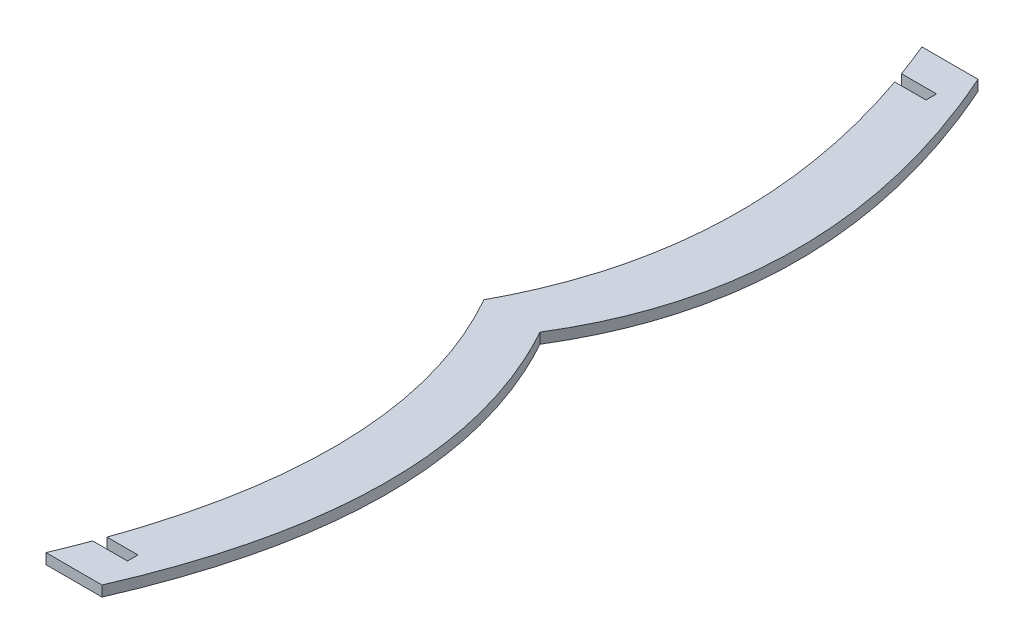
ISO-10303-21;
HEADER;
FILE_DESCRIPTION(('STEP AP214'),'2;1');
FILE_NAME('part.step','',(''),(''),'','','');
FILE_SCHEMA(('AUTOMOTIVE_DESIGN { 1 0 10303 214 1 1 1 1 }'));
ENDSEC;
DATA;
#1=APPLICATION_CONTEXT('core data for automotive mechanical design processes');
#2=APPLICATION_PROTOCOL_DEFINITION('international standard','automotive_design',2000,#1);
#3=PRODUCT_CONTEXT('',#1,'mechanical');
#4=PRODUCT('Part','Part','',(#3));
#5=PRODUCT_RELATED_PRODUCT_CATEGORY('part','',(#4));
#6=PRODUCT_DEFINITION_FORMATION('','',#4);
#7=PRODUCT_DEFINITION_CONTEXT('part definition',#1,'design');
#8=PRODUCT_DEFINITION('design','',#6,#7);
#9=PRODUCT_DEFINITION_SHAPE('','',#8);
#10=(LENGTH_UNIT() NAMED_UNIT(*) SI_UNIT(.MILLI.,.METRE.));
#11=(NAMED_UNIT(*) PLANE_ANGLE_UNIT() SI_UNIT($,.RADIAN.));
#12=(NAMED_UNIT(*) SI_UNIT($,.STERADIAN.) SOLID_ANGLE_UNIT());
#13=UNCERTAINTY_MEASURE_WITH_UNIT(LENGTH_MEASURE(1.E-05),#10,'distance_accuracy_value','');
#14=(GEOMETRIC_REPRESENTATION_CONTEXT(3) GLOBAL_UNCERTAINTY_ASSIGNED_CONTEXT((#13)) GLOBAL_UNIT_ASSIGNED_CONTEXT((#10,
#11,#12)) REPRESENTATION_CONTEXT('',''));
#15=CARTESIAN_POINT('',(0.,0.,0.));
#16=DIRECTION('',(0.,0.,1.));
#17=DIRECTION('',(1.,0.,0.));
#18=AXIS2_PLACEMENT_3D('',#15,#16,#17);
#19=CARTESIAN_POINT('',(0.,3.,-7.9624312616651));
#20=CARTESIAN_POINT('',(30.0897300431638,3.,45.5213233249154));
#21=CARTESIAN_POINT('',(0.,3.,117.037568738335));
#22=B_SPLINE_CURVE_WITH_KNOTS('',2,(#19,#20,#21),.UNSPECIFIED.,.F.,.F.,(3,3),(0.,
0.875472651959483),.UNSPECIFIED.);
#23=DIRECTION('',(0.,-1.,0.));
#24=VECTOR('',#23,1.);
#25=SURFACE_OF_LINEAR_EXTRUSION('',#22,#24);
#26=CARTESIAN_POINT('',(3.77859492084,3.,107.490220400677));
#27=VERTEX_POINT('',#26);
#28=CARTESIAN_POINT('',(0.,3.,117.037568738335));
#29=VERTEX_POINT('',#28);
#30=EDGE_CURVE('E183',#27,#29,#22,.T.);
#31=ORIENTED_EDGE('',*,*,#30,.F.);
#32=DIRECTION('',(0.,-1.,0.));
#33=VECTOR('',#32,1.);
#34=CARTESIAN_POINT('',(3.77859492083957,3.,107.490220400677));
#35=LINE('',#34,#33);
#36=CARTESIAN_POINT('',(3.77859492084,0.,107.490220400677));
#37=VERTEX_POINT('',#36);
#38=EDGE_CURVE('E139',#27,#37,#35,.T.);
#39=ORIENTED_EDGE('',*,*,#38,.T.);
#40=CARTESIAN_POINT('',(0.,0.,-7.9624312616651));
#41=CARTESIAN_POINT('',(30.0897300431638,0.,45.5213233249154));
#42=CARTESIAN_POINT('',(0.,0.,117.037568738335));
#43=B_SPLINE_CURVE_WITH_KNOTS('',2,(#40,#41,#42),.UNSPECIFIED.,.F.,.F.,(3,3),(0.,
0.875472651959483),.UNSPECIFIED.);
#44=CARTESIAN_POINT('',(0.,0.,117.037568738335));
#45=VERTEX_POINT('',#44);
#46=EDGE_CURVE('E236',#37,#45,#43,.T.);
#47=ORIENTED_EDGE('',*,*,#46,.T.);
#48=DIRECTION('',(0.,-1.,0.));
#49=VECTOR('',#48,1.);
#50=CARTESIAN_POINT('',(0.,3.,117.037568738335));
#51=LINE('',#50,#49);
#52=EDGE_CURVE('E277',#29,#45,#51,.T.);
#53=ORIENTED_EDGE('',*,*,#52,.F.);
#54=EDGE_LOOP('',(#31,#39,#47,#53));
#55=FACE_BOUND('',#54,.T.);
#56=ADVANCED_FACE('F32',(#55),#25,.F.);
#57=CARTESIAN_POINT('',(0.,3.,-132.962431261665));
#58=CARTESIAN_POINT('',(29.3110067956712,3.,-62.1066027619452));
#59=CARTESIAN_POINT('',(0.,3.,-7.9624312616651));
#60=B_SPLINE_CURVE_WITH_KNOTS('',2,(#57,#58,#59),.UNSPECIFIED.,.F.,.F.,(3,3),(0.,
0.889395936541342),.UNSPECIFIED.);
#61=DIRECTION('',(0.,-1.,0.));
#62=VECTOR('',#61,1.);
#63=SURFACE_OF_LINEAR_EXTRUSION('',#60,#62);
#64=CARTESIAN_POINT('',(0.,0.,-132.962431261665));
#65=CARTESIAN_POINT('',(29.3110067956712,0.,-62.1066027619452));
#66=CARTESIAN_POINT('',(0.,0.,-7.9624312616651));
#67=B_SPLINE_CURVE_WITH_KNOTS('',2,(#64,#65,#66),.UNSPECIFIED.,.F.,.F.,(3,3),(0.,
0.889395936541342),.UNSPECIFIED.);
#68=CARTESIAN_POINT('',(0.,0.,-132.962431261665));
#69=VERTEX_POINT('',#68);
#70=CARTESIAN_POINT('',(3.71095318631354,0.,-123.415082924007));
#71=VERTEX_POINT('',#70);
#72=EDGE_CURVE('E231',#69,#71,#67,.T.);
#73=ORIENTED_EDGE('',*,*,#72,.T.);
#74=DIRECTION('',(0.,1.,0.));
#75=VECTOR('',#74,1.);
#76=CARTESIAN_POINT('',(3.71095318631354,-36.71,-123.415082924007));
#77=LINE('',#76,#75);
#78=CARTESIAN_POINT('',(3.71095318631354,3.,-123.415082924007));
#79=VERTEX_POINT('',#78);
#80=EDGE_CURVE('E168',#71,#79,#77,.T.);
#81=ORIENTED_EDGE('',*,*,#80,.T.);
#82=CARTESIAN_POINT('',(0.,3.,-132.962431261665));
#83=VERTEX_POINT('',#82);
#84=EDGE_CURVE('E177',#83,#79,#60,.T.);
#85=ORIENTED_EDGE('',*,*,#84,.F.);
#86=DIRECTION('',(0.,-1.,0.));
#87=VECTOR('',#86,1.);
#88=CARTESIAN_POINT('',(0.,3.,-132.962431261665));
#89=LINE('',#88,#87);
#90=EDGE_CURVE('E230',#83,#69,#89,.T.);
#91=ORIENTED_EDGE('',*,*,#90,.T.);
#92=EDGE_LOOP('',(#73,#81,#85,#91));
#93=FACE_BOUND('',#92,.T.);
#94=ADVANCED_FACE('F315',(#93),#63,.F.);
#95=CARTESIAN_POINT('',(4.77640612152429,3.,-120.415082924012));
#96=VERTEX_POINT('',#95);
#97=CARTESIAN_POINT('',(0.,3.,-7.9624312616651));
#98=VERTEX_POINT('',#97);
#99=EDGE_CURVE('E184',#96,#98,#60,.T.);
#100=ORIENTED_EDGE('',*,*,#99,.F.);
#101=DIRECTION('',(0.,-1.,0.));
#102=VECTOR('',#101,1.);
#103=CARTESIAN_POINT('',(4.77640612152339,3.,-120.415082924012));
#104=LINE('',#103,#102);
#105=CARTESIAN_POINT('',(4.77640612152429,0.,-120.415082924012));
#106=VERTEX_POINT('',#105);
#107=EDGE_CURVE('E171',#96,#106,#104,.T.);
#108=ORIENTED_EDGE('',*,*,#107,.T.);
#109=CARTESIAN_POINT('',(0.,0.,-7.9624312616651));
#110=VERTEX_POINT('',#109);
#111=EDGE_CURVE('E176',#106,#110,#67,.T.);
#112=ORIENTED_EDGE('',*,*,#111,.T.);
#113=DIRECTION('',(0.,-1.,0.));
#114=VECTOR('',#113,1.);
#115=CARTESIAN_POINT('',(0.,3.,-7.9624312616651));
#116=LINE('',#115,#114);
#117=EDGE_CURVE('E280',#98,#110,#116,.T.);
#118=ORIENTED_EDGE('',*,*,#117,.F.);
#119=EDGE_LOOP('',(#100,#108,#112,#118));
#120=FACE_BOUND('',#119,.T.);
#121=ADVANCED_FACE('F34',(#120),#63,.F.);
#122=CARTESIAN_POINT('',(4.86523791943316,0.,104.490220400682));
#123=VERTEX_POINT('',#122);
#124=EDGE_CURVE('E237',#110,#123,#43,.T.);
#125=ORIENTED_EDGE('',*,*,#124,.T.);
#126=DIRECTION('',(0.,-1.,0.));
#127=VECTOR('',#126,1.);
#128=CARTESIAN_POINT('',(4.8652379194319,3.,104.490220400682));
#129=LINE('',#128,#127);
#130=CARTESIAN_POINT('',(4.86523791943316,3.,104.490220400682));
#131=VERTEX_POINT('',#130);
#132=EDGE_CURVE('E156',#123,#131,#129,.F.);
#133=ORIENTED_EDGE('',*,*,#132,.T.);
#134=EDGE_CURVE('E185',#98,#131,#22,.T.);
#135=ORIENTED_EDGE('',*,*,#134,.F.);
#136=ORIENTED_EDGE('',*,*,#117,.T.);
#137=EDGE_LOOP('',(#125,#133,#135,#136));
#138=FACE_BOUND('',#137,.T.);
#139=ADVANCED_FACE('F198',(#138),#25,.F.);
#140=CARTESIAN_POINT('',(0.,3.,117.037568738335));
#141=DIRECTION('',(0.,0.,-1.));
#142=DIRECTION('',(-1.,0.,0.));
#143=AXIS2_PLACEMENT_3D('',#140,#141,#142);
#144=PLANE('',#143);
#145=DIRECTION('',(1.,0.,0.));
#146=VECTOR('',#145,1.);
#147=CARTESIAN_POINT('',(0.,0.,117.037568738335));
#148=LINE('',#147,#146);
#149=CARTESIAN_POINT('',(16.,0.,117.037568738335));
#150=VERTEX_POINT('',#149);
#151=EDGE_CURVE('E245',#45,#150,#148,.T.);
#152=ORIENTED_EDGE('',*,*,#151,.T.);
#153=DIRECTION('',(0.,-1.,0.));
#154=VECTOR('',#153,1.);
#155=CARTESIAN_POINT('',(16.,3.,117.037568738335));
#156=LINE('',#155,#154);
#157=CARTESIAN_POINT('',(16.,3.,117.037568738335));
#158=VERTEX_POINT('',#157);
#159=EDGE_CURVE('E274',#158,#150,#156,.T.);
#160=ORIENTED_EDGE('',*,*,#159,.F.);
#161=DIRECTION('',(1.,0.,0.));
#162=VECTOR('',#161,1.);
#163=CARTESIAN_POINT('',(0.,3.,117.037568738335));
#164=LINE('',#163,#162);
#165=EDGE_CURVE('E193',#29,#158,#164,.T.);
#166=ORIENTED_EDGE('',*,*,#165,.F.);
#167=ORIENTED_EDGE('',*,*,#52,.T.);
#168=EDGE_LOOP('',(#152,#160,#166,#167));
#169=FACE_BOUND('',#168,.T.);
#170=ADVANCED_FACE('F201',(#169),#144,.F.);
#171=CARTESIAN_POINT('',(16.,3.,117.037568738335));
#172=CARTESIAN_POINT('',(46.347291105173,3.,47.146473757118));
#173=CARTESIAN_POINT('',(16.,3.,-7.9624312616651));
#174=B_SPLINE_CURVE_WITH_KNOTS('',2,(#171,#172,#173),.UNSPECIFIED.,.F.,.F.,(3,3),(0.,
0.679329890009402),.UNSPECIFIED.);
#175=DIRECTION('',(0.,-1.,0.));
#176=VECTOR('',#175,1.);
#177=SURFACE_OF_LINEAR_EXTRUSION('',#174,#176);
#178=CARTESIAN_POINT('',(16.,0.,117.037568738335));
#179=CARTESIAN_POINT('',(46.347291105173,0.,47.146473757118));
#180=CARTESIAN_POINT('',(16.,0.,-7.9624312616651));
#181=B_SPLINE_CURVE_WITH_KNOTS('',2,(#178,#179,#180),.UNSPECIFIED.,.F.,.F.,(3,3),(0.,
0.679329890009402),.UNSPECIFIED.);
#182=CARTESIAN_POINT('',(16.,0.,-7.9624312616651));
#183=VERTEX_POINT('',#182);
#184=EDGE_CURVE('E250',#150,#183,#181,.T.);
#185=ORIENTED_EDGE('',*,*,#184,.T.);
#186=DIRECTION('',(0.,-1.,0.));
#187=VECTOR('',#186,1.);
#188=CARTESIAN_POINT('',(16.,3.,-7.9624312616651));
#189=LINE('',#188,#187);
#190=CARTESIAN_POINT('',(16.,3.,-7.9624312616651));
#191=VERTEX_POINT('',#190);
#192=EDGE_CURVE('E271',#191,#183,#189,.T.);
#193=ORIENTED_EDGE('',*,*,#192,.F.);
#194=EDGE_CURVE('E213',#158,#191,#174,.T.);
#195=ORIENTED_EDGE('',*,*,#194,.F.);
#196=ORIENTED_EDGE('',*,*,#159,.T.);
#197=EDGE_LOOP('',(#185,#193,#195,#196));
#198=FACE_BOUND('',#197,.T.);
#199=ADVANCED_FACE('F205',(#198),#177,.F.);
#200=CARTESIAN_POINT('',(16.,3.,-7.9624312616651));
#201=CARTESIAN_POINT('',(48.2300407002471,3.,-60.3187396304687));
#202=CARTESIAN_POINT('',(16.,3.,-132.962431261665));
#203=B_SPLINE_CURVE_WITH_KNOTS('',2,(#200,#201,#202),.UNSPECIFIED.,.F.,.F.,(3,3),(0.,
0.900398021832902),.UNSPECIFIED.);
#204=DIRECTION('',(0.,-1.,0.));
#205=VECTOR('',#204,1.);
#206=SURFACE_OF_LINEAR_EXTRUSION('',#203,#205);
#207=CARTESIAN_POINT('',(16.,0.,-7.9624312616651));
#208=CARTESIAN_POINT('',(48.2300407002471,0.,-60.3187396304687));
#209=CARTESIAN_POINT('',(16.,0.,-132.962431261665));
#210=B_SPLINE_CURVE_WITH_KNOTS('',2,(#207,#208,#209),.UNSPECIFIED.,.F.,.F.,(3,3),(0.,
0.900398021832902),.UNSPECIFIED.);
#211=CARTESIAN_POINT('',(16.,0.,-132.962431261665));
#212=VERTEX_POINT('',#211);
#213=EDGE_CURVE('E254',#183,#212,#210,.T.);
#214=ORIENTED_EDGE('',*,*,#213,.T.);
#215=DIRECTION('',(0.,-1.,0.));
#216=VECTOR('',#215,1.);
#217=CARTESIAN_POINT('',(16.,3.,-132.962431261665));
#218=LINE('',#217,#216);
#219=CARTESIAN_POINT('',(16.,3.,-132.962431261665));
#220=VERTEX_POINT('',#219);
#221=EDGE_CURVE('E268',#220,#212,#218,.T.);
#222=ORIENTED_EDGE('',*,*,#221,.F.);
#223=EDGE_CURVE('E217',#191,#220,#203,.T.);
#224=ORIENTED_EDGE('',*,*,#223,.F.);
#225=ORIENTED_EDGE('',*,*,#192,.T.);
#226=EDGE_LOOP('',(#214,#222,#224,#225));
#227=FACE_BOUND('',#226,.T.);
#228=ADVANCED_FACE('F209',(#227),#206,.F.);
#229=CARTESIAN_POINT('',(0.,3.,-132.962431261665));
#230=DIRECTION('',(0.,0.,1.));
#231=DIRECTION('',(1.,0.,0.));
#232=AXIS2_PLACEMENT_3D('',#229,#230,#231);
#233=PLANE('',#232);
#234=DIRECTION('',(-1.,0.,0.));
#235=VECTOR('',#234,1.);
#236=CARTESIAN_POINT('',(0.,0.,-132.962431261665));
#237=LINE('',#236,#235);
#238=EDGE_CURVE('E261',#212,#69,#237,.T.);
#239=ORIENTED_EDGE('',*,*,#238,.T.);
#240=ORIENTED_EDGE('',*,*,#90,.F.);
#241=DIRECTION('',(-1.,0.,0.));
#242=VECTOR('',#241,1.);
#243=CARTESIAN_POINT('',(0.,3.,-132.962431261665));
#244=LINE('',#243,#242);
#245=EDGE_CURVE('E225',#220,#83,#244,.T.);
#246=ORIENTED_EDGE('',*,*,#245,.F.);
#247=ORIENTED_EDGE('',*,*,#221,.T.);
#248=EDGE_LOOP('',(#239,#240,#246,#247));
#249=FACE_BOUND('',#248,.T.);
#250=ADVANCED_FACE('F320',(#249),#233,.F.);
#251=CARTESIAN_POINT('',(14.6555033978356,3.,-66.2845170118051));
#252=DIRECTION('',(0.,1.,0.));
#253=DIRECTION('',(0.,0.,1.));
#254=AXIS2_PLACEMENT_3D('',#251,#252,#253);
#255=PLANE('',#254);
#256=DIRECTION('',(1.,0.,0.));
#257=VECTOR('',#256,1.);
#258=CARTESIAN_POINT('',(3.71095318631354,3.,107.490220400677));
#259=LINE('',#258,#257);
#260=CARTESIAN_POINT('',(13.7109531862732,3.,107.490220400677));
#261=VERTEX_POINT('',#260);
#262=EDGE_CURVE('E134',#27,#261,#259,.T.);
#263=ORIENTED_EDGE('',*,*,#262,.F.);
#264=ORIENTED_EDGE('',*,*,#30,.T.);
#265=ORIENTED_EDGE('',*,*,#165,.T.);
#266=ORIENTED_EDGE('',*,*,#194,.T.);
#267=ORIENTED_EDGE('',*,*,#223,.T.);
#268=ORIENTED_EDGE('',*,*,#245,.T.);
#269=ORIENTED_EDGE('',*,*,#84,.T.);
#270=DIRECTION('',(-1.,0.,5.44009282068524E-13));
#271=VECTOR('',#270,1.);
#272=CARTESIAN_POINT('',(3.71095318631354,3.,-123.415082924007));
#273=LINE('',#272,#271);
#274=CARTESIAN_POINT('',(13.7109531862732,3.,-123.415082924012));
#275=VERTEX_POINT('',#274);
#276=EDGE_CURVE('E166',#275,#79,#273,.T.);
#277=ORIENTED_EDGE('',*,*,#276,.F.);
#278=DIRECTION('',(0.,0.,-1.));
#279=VECTOR('',#278,1.);
#280=CARTESIAN_POINT('',(13.7109531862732,3.,-123.415082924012));
#281=LINE('',#280,#279);
#282=CARTESIAN_POINT('',(13.7109531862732,3.,-120.415082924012));
#283=VERTEX_POINT('',#282);
#284=EDGE_CURVE('E163',#283,#275,#281,.T.);
#285=ORIENTED_EDGE('',*,*,#284,.F.);
#286=DIRECTION('',(1.,0.,0.));
#287=VECTOR('',#286,1.);
#288=CARTESIAN_POINT('',(3.71095318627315,3.,-120.415082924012));
#289=LINE('',#288,#287);
#290=EDGE_CURVE('E161',#96,#283,#289,.T.);
#291=ORIENTED_EDGE('',*,*,#290,.F.);
#292=ORIENTED_EDGE('',*,*,#99,.T.);
#293=ORIENTED_EDGE('',*,*,#134,.T.);
#294=DIRECTION('',(-1.,0.,0.));
#295=VECTOR('',#294,1.);
#296=CARTESIAN_POINT('',(3.71095318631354,3.,104.490220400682));
#297=LINE('',#296,#295);
#298=CARTESIAN_POINT('',(13.7109531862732,3.,104.490220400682));
#299=VERTEX_POINT('',#298);
#300=EDGE_CURVE('E149',#299,#131,#297,.T.);
#301=ORIENTED_EDGE('',*,*,#300,.F.);
#302=DIRECTION('',(0.,0.,-1.));
#303=VECTOR('',#302,1.);
#304=CARTESIAN_POINT('',(13.7109531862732,3.,107.490220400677));
#305=LINE('',#304,#303);
#306=EDGE_CURVE('E143',#261,#299,#305,.T.);
#307=ORIENTED_EDGE('',*,*,#306,.F.);
#308=EDGE_LOOP('',(#263,#264,#265,#266,#267,#268,#269,#277,#285,#291,#292,#293,#301,#307));
#309=FACE_BOUND('',#308,.T.);
#310=ADVANCED_FACE('F151',(#309),#255,.T.);
#311=CARTESIAN_POINT('',(14.6555033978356,0.,-66.2845170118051));
#312=DIRECTION('',(0.,1.,0.));
#313=DIRECTION('',(0.,0.,1.));
#314=AXIS2_PLACEMENT_3D('',#311,#312,#313);
#315=PLANE('',#314);
#316=ORIENTED_EDGE('',*,*,#46,.F.);
#317=DIRECTION('',(1.,0.,0.));
#318=VECTOR('',#317,1.);
#319=CARTESIAN_POINT('',(14.6555033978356,0.,107.490220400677));
#320=LINE('',#319,#318);
#321=CARTESIAN_POINT('',(13.7109531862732,0.,107.490220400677));
#322=VERTEX_POINT('',#321);
#323=EDGE_CURVE('E11',#37,#322,#320,.T.);
#324=ORIENTED_EDGE('',*,*,#323,.T.);
#325=DIRECTION('',(0.,0.,-1.));
#326=VECTOR('',#325,1.);
#327=CARTESIAN_POINT('',(13.7109531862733,0.,-66.2845170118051));
#328=LINE('',#327,#326);
#329=CARTESIAN_POINT('',(13.7109531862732,0.,104.490220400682));
#330=VERTEX_POINT('',#329);
#331=EDGE_CURVE('E148',#322,#330,#328,.T.);
#332=ORIENTED_EDGE('',*,*,#331,.T.);
#333=DIRECTION('',(-1.,0.,0.));
#334=VECTOR('',#333,1.);
#335=CARTESIAN_POINT('',(14.6555033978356,0.,104.490220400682));
#336=LINE('',#335,#334);
#337=EDGE_CURVE('E41',#330,#123,#336,.T.);
#338=ORIENTED_EDGE('',*,*,#337,.T.);
#339=ORIENTED_EDGE('',*,*,#124,.F.);
#340=ORIENTED_EDGE('',*,*,#111,.F.);
#341=DIRECTION('',(1.,0.,0.));
#342=VECTOR('',#341,1.);
#343=CARTESIAN_POINT('',(14.6555033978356,0.,-120.415082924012));
#344=LINE('',#343,#342);
#345=CARTESIAN_POINT('',(13.7109531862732,0.,-120.415082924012));
#346=VERTEX_POINT('',#345);
#347=EDGE_CURVE('E283',#106,#346,#344,.T.);
#348=ORIENTED_EDGE('',*,*,#347,.T.);
#349=DIRECTION('',(0.,0.,-1.));
#350=VECTOR('',#349,1.);
#351=CARTESIAN_POINT('',(13.7109531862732,0.,-66.2845170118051));
#352=LINE('',#351,#350);
#353=CARTESIAN_POINT('',(13.7109531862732,0.,-123.415082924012));
#354=VERTEX_POINT('',#353);
#355=EDGE_CURVE('E286',#346,#354,#352,.T.);
#356=ORIENTED_EDGE('',*,*,#355,.T.);
#357=DIRECTION('',(-1.,0.,5.44009282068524E-13));
#358=VECTOR('',#357,1.);
#359=CARTESIAN_POINT('',(14.6555033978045,0.,-123.415082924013));
#360=LINE('',#359,#358);
#361=EDGE_CURVE('E289',#354,#71,#360,.T.);
#362=ORIENTED_EDGE('',*,*,#361,.T.);
#363=ORIENTED_EDGE('',*,*,#72,.F.);
#364=ORIENTED_EDGE('',*,*,#238,.F.);
#365=ORIENTED_EDGE('',*,*,#213,.F.);
#366=ORIENTED_EDGE('',*,*,#184,.F.);
#367=ORIENTED_EDGE('',*,*,#151,.F.);
#368=EDGE_LOOP('',(#316,#324,#332,#338,#339,#340,#348,#356,#362,#363,#364,#365,#366,#367));
#369=FACE_BOUND('',#368,.T.);
#370=ADVANCED_FACE('F296',(#369),#315,.F.);
#371=CARTESIAN_POINT('',(3.71095318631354,-36.71,-123.415082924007));
#372=DIRECTION('',(-5.44009282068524E-13,0.,-1.));
#373=DIRECTION('',(-1.,0.,5.44009282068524E-13));
#374=AXIS2_PLACEMENT_3D('',#371,#372,#373);
#375=PLANE('',#374);
#376=DIRECTION('',(0.,1.,0.));
#377=VECTOR('',#376,1.);
#378=CARTESIAN_POINT('',(13.7109531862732,-36.71,-123.415082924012));
#379=LINE('',#378,#377);
#380=EDGE_CURVE('E172',#354,#275,#379,.T.);
#381=ORIENTED_EDGE('',*,*,#380,.T.);
#382=ORIENTED_EDGE('',*,*,#276,.T.);
#383=ORIENTED_EDGE('',*,*,#80,.F.);
#384=ORIENTED_EDGE('',*,*,#361,.F.);
#385=EDGE_LOOP('',(#381,#382,#383,#384));
#386=FACE_BOUND('',#385,.T.);
#387=ADVANCED_FACE('F311',(#386),#375,.F.);
#388=CARTESIAN_POINT('',(13.7109531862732,-36.71,-123.415082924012));
#389=DIRECTION('',(1.,0.,0.));
#390=DIRECTION('',(0.,0.,-1.));
#391=AXIS2_PLACEMENT_3D('',#388,#389,#390);
#392=PLANE('',#391);
#393=DIRECTION('',(0.,1.,0.));
#394=VECTOR('',#393,1.);
#395=CARTESIAN_POINT('',(13.7109531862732,-36.71,-120.415082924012));
#396=LINE('',#395,#394);
#397=EDGE_CURVE('E56',#346,#283,#396,.T.);
#398=ORIENTED_EDGE('',*,*,#397,.T.);
#399=ORIENTED_EDGE('',*,*,#284,.T.);
#400=ORIENTED_EDGE('',*,*,#380,.F.);
#401=ORIENTED_EDGE('',*,*,#355,.F.);
#402=EDGE_LOOP('',(#398,#399,#400,#401));
#403=FACE_BOUND('',#402,.T.);
#404=ADVANCED_FACE('F309',(#403),#392,.F.);
#405=CARTESIAN_POINT('',(3.71095318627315,-36.71,-120.415082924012));
#406=DIRECTION('',(0.,0.,1.));
#407=DIRECTION('',(1.,0.,0.));
#408=AXIS2_PLACEMENT_3D('',#405,#406,#407);
#409=PLANE('',#408);
#410=ORIENTED_EDGE('',*,*,#290,.T.);
#411=ORIENTED_EDGE('',*,*,#397,.F.);
#412=ORIENTED_EDGE('',*,*,#347,.F.);
#413=ORIENTED_EDGE('',*,*,#107,.F.);
#414=EDGE_LOOP('',(#410,#411,#412,#413));
#415=FACE_BOUND('',#414,.T.);
#416=ADVANCED_FACE('F303',(#415),#409,.F.);
#417=CARTESIAN_POINT('',(3.71095318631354,-36.71,107.490220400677));
#418=DIRECTION('',(0.,0.,1.));
#419=DIRECTION('',(1.,0.,0.));
#420=AXIS2_PLACEMENT_3D('',#417,#418,#419);
#421=PLANE('',#420);
#422=ORIENTED_EDGE('',*,*,#262,.T.);
#423=DIRECTION('',(0.,1.,0.));
#424=VECTOR('',#423,1.);
#425=CARTESIAN_POINT('',(13.7109531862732,-36.71,107.490220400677));
#426=LINE('',#425,#424);
#427=EDGE_CURVE('E137',#322,#261,#426,.T.);
#428=ORIENTED_EDGE('',*,*,#427,.F.);
#429=ORIENTED_EDGE('',*,*,#323,.F.);
#430=ORIENTED_EDGE('',*,*,#38,.F.);
#431=EDGE_LOOP('',(#422,#428,#429,#430));
#432=FACE_BOUND('',#431,.T.);
#433=ADVANCED_FACE('F136',(#432),#421,.F.);
#434=CARTESIAN_POINT('',(3.71095318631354,-36.71,104.490220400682));
#435=DIRECTION('',(0.,0.,-1.));
#436=DIRECTION('',(-1.,0.,0.));
#437=AXIS2_PLACEMENT_3D('',#434,#435,#436);
#438=PLANE('',#437);
#439=ORIENTED_EDGE('',*,*,#337,.F.);
#440=DIRECTION('',(0.,1.,0.));
#441=VECTOR('',#440,1.);
#442=CARTESIAN_POINT('',(13.7109531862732,-36.71,104.490220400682));
#443=LINE('',#442,#441);
#444=EDGE_CURVE('E48',#330,#299,#443,.T.);
#445=ORIENTED_EDGE('',*,*,#444,.T.);
#446=ORIENTED_EDGE('',*,*,#300,.T.);
#447=ORIENTED_EDGE('',*,*,#132,.F.);
#448=EDGE_LOOP('',(#439,#445,#446,#447));
#449=FACE_BOUND('',#448,.T.);
#450=ADVANCED_FACE('F400',(#449),#438,.F.);
#451=CARTESIAN_POINT('',(13.7109531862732,-36.71,107.490220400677));
#452=DIRECTION('',(1.,0.,0.));
#453=DIRECTION('',(0.,0.,-1.));
#454=AXIS2_PLACEMENT_3D('',#451,#452,#453);
#455=PLANE('',#454);
#456=ORIENTED_EDGE('',*,*,#427,.T.);
#457=ORIENTED_EDGE('',*,*,#306,.T.);
#458=ORIENTED_EDGE('',*,*,#444,.F.);
#459=ORIENTED_EDGE('',*,*,#331,.F.);
#460=EDGE_LOOP('',(#456,#457,#458,#459));
#461=FACE_BOUND('',#460,.T.);
#462=ADVANCED_FACE('F145',(#461),#455,.F.);
#463=CLOSED_SHELL('',(#56,#94,#121,#139,#170,#199,#228,#250,#310,#370,#387,#404,#416,#433,#450,#462));
#464=MANIFOLD_SOLID_BREP('B2',#463);
#465=ADVANCED_BREP_SHAPE_REPRESENTATION('',(#18,#464),#14);
#466=SHAPE_DEFINITION_REPRESENTATION(#9,#465);
ENDSEC;
END-ISO-10303-21;
